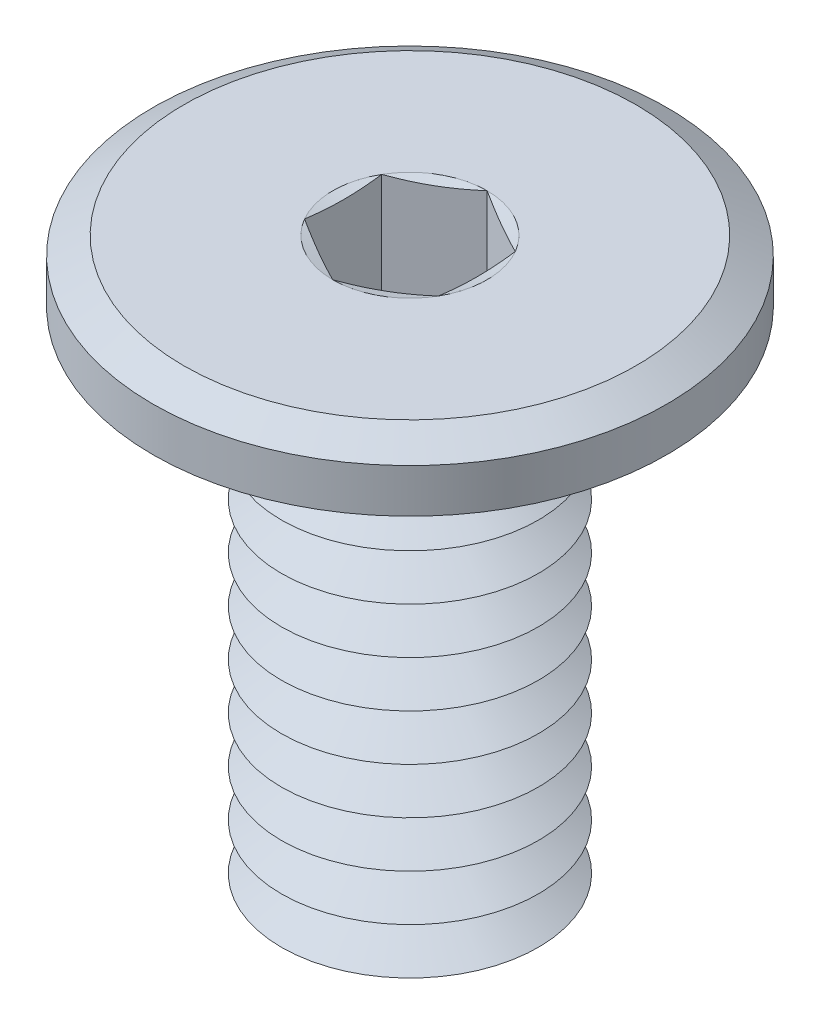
ISO-10303-21;
HEADER;
FILE_DESCRIPTION(('STEP AP214'),'2;1');
FILE_NAME('part.step','',(''),(''),'','','');
FILE_SCHEMA(('AUTOMOTIVE_DESIGN { 1 0 10303 214 1 1 1 1 }'));
ENDSEC;
DATA;
#1=APPLICATION_CONTEXT('core data for automotive mechanical design processes');
#2=APPLICATION_PROTOCOL_DEFINITION('international standard','automotive_design',2000,#1);
#3=PRODUCT_CONTEXT('',#1,'mechanical');
#4=PRODUCT('Part','Part','',(#3));
#5=PRODUCT_RELATED_PRODUCT_CATEGORY('part','',(#4));
#6=PRODUCT_DEFINITION_FORMATION('','',#4);
#7=PRODUCT_DEFINITION_CONTEXT('part definition',#1,'design');
#8=PRODUCT_DEFINITION('design','',#6,#7);
#9=PRODUCT_DEFINITION_SHAPE('','',#8);
#10=(LENGTH_UNIT() NAMED_UNIT(*) SI_UNIT(.MILLI.,.METRE.));
#11=(NAMED_UNIT(*) PLANE_ANGLE_UNIT() SI_UNIT($,.RADIAN.));
#12=(NAMED_UNIT(*) SI_UNIT($,.STERADIAN.) SOLID_ANGLE_UNIT());
#13=UNCERTAINTY_MEASURE_WITH_UNIT(LENGTH_MEASURE(1.E-05),#10,'distance_accuracy_value','');
#14=(GEOMETRIC_REPRESENTATION_CONTEXT(3) GLOBAL_UNCERTAINTY_ASSIGNED_CONTEXT((#13)) GLOBAL_UNIT_ASSIGNED_CONTEXT((#10,
#11,#12)) REPRESENTATION_CONTEXT('',''));
#15=CARTESIAN_POINT('',(0.,0.,0.));
#16=DIRECTION('',(0.,0.,1.));
#17=DIRECTION('',(1.,0.,0.));
#18=AXIS2_PLACEMENT_3D('',#15,#16,#17);
#19=CARTESIAN_POINT('',(0.,-4.925,0.));
#20=DIRECTION('',(0.,-1.,0.));
#21=DIRECTION('',(0.,0.,-1.));
#22=AXIS2_PLACEMENT_3D('',#19,#20,#21);
#23=CONICAL_SURFACE('',#22,1.25,1.0471975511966);
#24=CARTESIAN_POINT('',(0.,-4.7,0.));
#25=DIRECTION('',(0.,1.,0.));
#26=DIRECTION('',(0.,0.,1.));
#27=AXIS2_PLACEMENT_3D('',#24,#25,#26);
#28=CIRCLE('',#27,0.860288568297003);
#29=CARTESIAN_POINT('',(0.,-4.7,0.860288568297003));
#30=VERTEX_POINT('',#29);
#31=EDGE_CURVE('E433',#30,#30,#28,.T.);
#32=ORIENTED_EDGE('',*,*,#31,.F.);
#33=EDGE_LOOP('',(#32));
#34=FACE_BOUND('',#33,.T.);
#35=CARTESIAN_POINT('',(0.,-4.925,0.));
#36=DIRECTION('',(0.,1.,0.));
#37=DIRECTION('',(0.,0.,1.));
#38=AXIS2_PLACEMENT_3D('',#35,#36,#37);
#39=CIRCLE('',#38,1.25);
#40=CARTESIAN_POINT('',(0.,-4.925,1.25));
#41=VERTEX_POINT('',#40);
#42=EDGE_CURVE('E437',#41,#41,#39,.T.);
#43=ORIENTED_EDGE('',*,*,#42,.T.);
#44=EDGE_LOOP('',(#43));
#45=FACE_BOUND('',#44,.T.);
#46=ADVANCED_FACE('F39',(#34,#45),#23,.T.);
#47=CARTESIAN_POINT('',(0.,-4.7,0.));
#48=DIRECTION('',(0.,1.,0.));
#49=DIRECTION('',(0.,0.,1.));
#50=AXIS2_PLACEMENT_3D('',#47,#48,#49);
#51=CONICAL_SURFACE('',#50,0.860288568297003,1.0471975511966);
#52=CARTESIAN_POINT('',(0.,-4.475,0.));
#53=DIRECTION('',(0.,1.,0.));
#54=DIRECTION('',(0.,0.,1.));
#55=AXIS2_PLACEMENT_3D('',#52,#53,#54);
#56=CIRCLE('',#55,1.25);
#57=CARTESIAN_POINT('',(0.,-4.475,1.25));
#58=VERTEX_POINT('',#57);
#59=EDGE_CURVE('E429',#58,#58,#56,.T.);
#60=ORIENTED_EDGE('',*,*,#59,.F.);
#61=EDGE_LOOP('',(#60));
#62=FACE_BOUND('',#61,.T.);
#63=ORIENTED_EDGE('',*,*,#31,.T.);
#64=EDGE_LOOP('',(#63));
#65=FACE_BOUND('',#64,.T.);
#66=ADVANCED_FACE('F233',(#62,#65),#51,.T.);
#67=CARTESIAN_POINT('',(0.,-5.6,0.));
#68=DIRECTION('',(0.,-1.,0.));
#69=DIRECTION('',(0.,0.,-1.));
#70=AXIS2_PLACEMENT_3D('',#67,#68,#69);
#71=PLANE('',#70);
#72=CARTESIAN_POINT('',(0.,-5.6,0.));
#73=DIRECTION('',(0.,1.,0.));
#74=DIRECTION('',(0.,0.,1.));
#75=AXIS2_PLACEMENT_3D('',#72,#73,#74);
#76=CIRCLE('',#75,0.860288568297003);
#77=CARTESIAN_POINT('',(0.,-5.6,0.860288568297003));
#78=VERTEX_POINT('',#77);
#79=EDGE_CURVE('E299',#78,#78,#76,.T.);
#80=ORIENTED_EDGE('',*,*,#79,.F.);
#81=EDGE_LOOP('',(#80));
#82=FACE_BOUND('',#81,.T.);
#83=ADVANCED_FACE('F239',(#82),#71,.T.);
#84=CARTESIAN_POINT('',(0.,-5.6,0.));
#85=DIRECTION('',(0.,1.,0.));
#86=DIRECTION('',(0.,0.,1.));
#87=AXIS2_PLACEMENT_3D('',#84,#85,#86);
#88=CONICAL_SURFACE('',#87,0.860288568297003,1.0471975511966);
#89=CARTESIAN_POINT('',(0.,-5.375,0.));
#90=DIRECTION('',(0.,1.,0.));
#91=DIRECTION('',(0.,0.,1.));
#92=AXIS2_PLACEMENT_3D('',#89,#90,#91);
#93=CIRCLE('',#92,1.25);
#94=CARTESIAN_POINT('',(0.,-5.375,1.25));
#95=VERTEX_POINT('',#94);
#96=EDGE_CURVE('E445',#95,#95,#93,.T.);
#97=ORIENTED_EDGE('',*,*,#96,.F.);
#98=EDGE_LOOP('',(#97));
#99=FACE_BOUND('',#98,.T.);
#100=ORIENTED_EDGE('',*,*,#79,.T.);
#101=EDGE_LOOP('',(#100));
#102=FACE_BOUND('',#101,.T.);
#103=ADVANCED_FACE('F254',(#99,#102),#88,.T.);
#104=CARTESIAN_POINT('',(0.,-5.375,0.));
#105=DIRECTION('',(0.,-1.,0.));
#106=DIRECTION('',(0.,0.,-1.));
#107=AXIS2_PLACEMENT_3D('',#104,#105,#106);
#108=CONICAL_SURFACE('',#107,1.25,1.0471975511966);
#109=CARTESIAN_POINT('',(0.,-5.15,0.));
#110=DIRECTION('',(0.,1.,0.));
#111=DIRECTION('',(0.,0.,1.));
#112=AXIS2_PLACEMENT_3D('',#109,#110,#111);
#113=CIRCLE('',#112,0.860288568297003);
#114=CARTESIAN_POINT('',(0.,-5.15,0.860288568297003));
#115=VERTEX_POINT('',#114);
#116=EDGE_CURVE('E441',#115,#115,#113,.T.);
#117=ORIENTED_EDGE('',*,*,#116,.F.);
#118=EDGE_LOOP('',(#117));
#119=FACE_BOUND('',#118,.T.);
#120=ORIENTED_EDGE('',*,*,#96,.T.);
#121=EDGE_LOOP('',(#120));
#122=FACE_BOUND('',#121,.T.);
#123=ADVANCED_FACE('F250',(#119,#122),#108,.T.);
#124=CARTESIAN_POINT('',(0.,-5.15,0.));
#125=DIRECTION('',(0.,1.,0.));
#126=DIRECTION('',(0.,0.,1.));
#127=AXIS2_PLACEMENT_3D('',#124,#125,#126);
#128=CONICAL_SURFACE('',#127,0.860288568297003,1.0471975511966);
#129=ORIENTED_EDGE('',*,*,#42,.F.);
#130=EDGE_LOOP('',(#129));
#131=FACE_BOUND('',#130,.T.);
#132=ORIENTED_EDGE('',*,*,#116,.T.);
#133=EDGE_LOOP('',(#132));
#134=FACE_BOUND('',#133,.T.);
#135=ADVANCED_FACE('F246',(#131,#134),#128,.T.);
#136=CARTESIAN_POINT('',(0.,-4.475,0.));
#137=DIRECTION('',(0.,-1.,0.));
#138=DIRECTION('',(0.,0.,-1.));
#139=AXIS2_PLACEMENT_3D('',#136,#137,#138);
#140=CONICAL_SURFACE('',#139,1.25,1.0471975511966);
#141=CARTESIAN_POINT('',(0.,-4.25,0.));
#142=DIRECTION('',(0.,1.,0.));
#143=DIRECTION('',(0.,0.,1.));
#144=AXIS2_PLACEMENT_3D('',#141,#142,#143);
#145=CIRCLE('',#144,0.860288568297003);
#146=CARTESIAN_POINT('',(0.,-4.25,0.860288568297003));
#147=VERTEX_POINT('',#146);
#148=EDGE_CURVE('E425',#147,#147,#145,.T.);
#149=ORIENTED_EDGE('',*,*,#148,.F.);
#150=EDGE_LOOP('',(#149));
#151=FACE_BOUND('',#150,.T.);
#152=ORIENTED_EDGE('',*,*,#59,.T.);
#153=EDGE_LOOP('',(#152));
#154=FACE_BOUND('',#153,.T.);
#155=ADVANCED_FACE('F249',(#151,#154),#140,.T.);
#156=CARTESIAN_POINT('',(0.,-4.25,0.));
#157=DIRECTION('',(0.,1.,0.));
#158=DIRECTION('',(0.,0.,1.));
#159=AXIS2_PLACEMENT_3D('',#156,#157,#158);
#160=CONICAL_SURFACE('',#159,0.860288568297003,1.0471975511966);
#161=CARTESIAN_POINT('',(0.,-4.025,0.));
#162=DIRECTION('',(0.,1.,0.));
#163=DIRECTION('',(0.,0.,1.));
#164=AXIS2_PLACEMENT_3D('',#161,#162,#163);
#165=CIRCLE('',#164,1.25);
#166=CARTESIAN_POINT('',(0.,-4.025,1.25));
#167=VERTEX_POINT('',#166);
#168=EDGE_CURVE('E421',#167,#167,#165,.T.);
#169=ORIENTED_EDGE('',*,*,#168,.F.);
#170=EDGE_LOOP('',(#169));
#171=FACE_BOUND('',#170,.T.);
#172=ORIENTED_EDGE('',*,*,#148,.T.);
#173=EDGE_LOOP('',(#172));
#174=FACE_BOUND('',#173,.T.);
#175=ADVANCED_FACE('F550',(#171,#174),#160,.T.);
#176=CARTESIAN_POINT('',(0.,-4.025,0.));
#177=DIRECTION('',(0.,-1.,0.));
#178=DIRECTION('',(0.,0.,-1.));
#179=AXIS2_PLACEMENT_3D('',#176,#177,#178);
#180=CONICAL_SURFACE('',#179,1.25,1.0471975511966);
#181=CARTESIAN_POINT('',(0.,-3.8,0.));
#182=DIRECTION('',(0.,1.,0.));
#183=DIRECTION('',(0.,0.,1.));
#184=AXIS2_PLACEMENT_3D('',#181,#182,#183);
#185=CIRCLE('',#184,0.860288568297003);
#186=CARTESIAN_POINT('',(0.,-3.8,0.860288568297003));
#187=VERTEX_POINT('',#186);
#188=EDGE_CURVE('E417',#187,#187,#185,.T.);
#189=ORIENTED_EDGE('',*,*,#188,.F.);
#190=EDGE_LOOP('',(#189));
#191=FACE_BOUND('',#190,.T.);
#192=ORIENTED_EDGE('',*,*,#168,.T.);
#193=EDGE_LOOP('',(#192));
#194=FACE_BOUND('',#193,.T.);
#195=ADVANCED_FACE('F546',(#191,#194),#180,.T.);
#196=CARTESIAN_POINT('',(0.,-3.8,0.));
#197=DIRECTION('',(0.,1.,0.));
#198=DIRECTION('',(0.,0.,1.));
#199=AXIS2_PLACEMENT_3D('',#196,#197,#198);
#200=CONICAL_SURFACE('',#199,0.860288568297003,1.0471975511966);
#201=CARTESIAN_POINT('',(0.,-3.575,0.));
#202=DIRECTION('',(0.,1.,0.));
#203=DIRECTION('',(0.,0.,1.));
#204=AXIS2_PLACEMENT_3D('',#201,#202,#203);
#205=CIRCLE('',#204,1.25);
#206=CARTESIAN_POINT('',(0.,-3.575,1.25));
#207=VERTEX_POINT('',#206);
#208=EDGE_CURVE('E413',#207,#207,#205,.T.);
#209=ORIENTED_EDGE('',*,*,#208,.F.);
#210=EDGE_LOOP('',(#209));
#211=FACE_BOUND('',#210,.T.);
#212=ORIENTED_EDGE('',*,*,#188,.T.);
#213=EDGE_LOOP('',(#212));
#214=FACE_BOUND('',#213,.T.);
#215=ADVANCED_FACE('F542',(#211,#214),#200,.T.);
#216=CARTESIAN_POINT('',(0.,-3.575,0.));
#217=DIRECTION('',(0.,-1.,0.));
#218=DIRECTION('',(0.,0.,-1.));
#219=AXIS2_PLACEMENT_3D('',#216,#217,#218);
#220=CONICAL_SURFACE('',#219,1.25,1.0471975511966);
#221=CARTESIAN_POINT('',(0.,-3.35,0.));
#222=DIRECTION('',(0.,1.,0.));
#223=DIRECTION('',(0.,0.,1.));
#224=AXIS2_PLACEMENT_3D('',#221,#222,#223);
#225=CIRCLE('',#224,0.860288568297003);
#226=CARTESIAN_POINT('',(0.,-3.35,0.860288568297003));
#227=VERTEX_POINT('',#226);
#228=EDGE_CURVE('E410',#227,#227,#225,.T.);
#229=ORIENTED_EDGE('',*,*,#228,.F.);
#230=EDGE_LOOP('',(#229));
#231=FACE_BOUND('',#230,.T.);
#232=ORIENTED_EDGE('',*,*,#208,.T.);
#233=EDGE_LOOP('',(#232));
#234=FACE_BOUND('',#233,.T.);
#235=ADVANCED_FACE('F538',(#231,#234),#220,.T.);
#236=CARTESIAN_POINT('',(0.,-3.35,0.));
#237=DIRECTION('',(0.,1.,0.));
#238=DIRECTION('',(0.,0.,1.));
#239=AXIS2_PLACEMENT_3D('',#236,#237,#238);
#240=CONICAL_SURFACE('',#239,0.860288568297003,1.0471975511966);
#241=CARTESIAN_POINT('',(0.,-3.125,0.));
#242=DIRECTION('',(0.,1.,0.));
#243=DIRECTION('',(0.,0.,1.));
#244=AXIS2_PLACEMENT_3D('',#241,#242,#243);
#245=CIRCLE('',#244,1.25);
#246=CARTESIAN_POINT('',(0.,-3.125,1.25));
#247=VERTEX_POINT('',#246);
#248=EDGE_CURVE('E406',#247,#247,#245,.T.);
#249=ORIENTED_EDGE('',*,*,#248,.F.);
#250=EDGE_LOOP('',(#249));
#251=FACE_BOUND('',#250,.T.);
#252=ORIENTED_EDGE('',*,*,#228,.T.);
#253=EDGE_LOOP('',(#252));
#254=FACE_BOUND('',#253,.T.);
#255=ADVANCED_FACE('F534',(#251,#254),#240,.T.);
#256=CARTESIAN_POINT('',(0.,-3.125,0.));
#257=DIRECTION('',(0.,-1.,0.));
#258=DIRECTION('',(0.,0.,-1.));
#259=AXIS2_PLACEMENT_3D('',#256,#257,#258);
#260=CONICAL_SURFACE('',#259,1.25,1.0471975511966);
#261=CARTESIAN_POINT('',(0.,-2.9,0.));
#262=DIRECTION('',(0.,1.,0.));
#263=DIRECTION('',(0.,0.,1.));
#264=AXIS2_PLACEMENT_3D('',#261,#262,#263);
#265=CIRCLE('',#264,0.860288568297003);
#266=CARTESIAN_POINT('',(0.,-2.9,0.860288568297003));
#267=VERTEX_POINT('',#266);
#268=EDGE_CURVE('E402',#267,#267,#265,.T.);
#269=ORIENTED_EDGE('',*,*,#268,.F.);
#270=EDGE_LOOP('',(#269));
#271=FACE_BOUND('',#270,.T.);
#272=ORIENTED_EDGE('',*,*,#248,.T.);
#273=EDGE_LOOP('',(#272));
#274=FACE_BOUND('',#273,.T.);
#275=ADVANCED_FACE('F530',(#271,#274),#260,.T.);
#276=CARTESIAN_POINT('',(0.,-2.9,0.));
#277=DIRECTION('',(0.,1.,0.));
#278=DIRECTION('',(0.,0.,1.));
#279=AXIS2_PLACEMENT_3D('',#276,#277,#278);
#280=CONICAL_SURFACE('',#279,0.860288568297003,1.0471975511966);
#281=CARTESIAN_POINT('',(0.,-2.675,0.));
#282=DIRECTION('',(0.,1.,0.));
#283=DIRECTION('',(0.,0.,1.));
#284=AXIS2_PLACEMENT_3D('',#281,#282,#283);
#285=CIRCLE('',#284,1.25);
#286=CARTESIAN_POINT('',(0.,-2.675,1.25));
#287=VERTEX_POINT('',#286);
#288=EDGE_CURVE('E398',#287,#287,#285,.T.);
#289=ORIENTED_EDGE('',*,*,#288,.F.);
#290=EDGE_LOOP('',(#289));
#291=FACE_BOUND('',#290,.T.);
#292=ORIENTED_EDGE('',*,*,#268,.T.);
#293=EDGE_LOOP('',(#292));
#294=FACE_BOUND('',#293,.T.);
#295=ADVANCED_FACE('F526',(#291,#294),#280,.T.);
#296=CARTESIAN_POINT('',(0.,-2.675,0.));
#297=DIRECTION('',(0.,-1.,0.));
#298=DIRECTION('',(0.,0.,-1.));
#299=AXIS2_PLACEMENT_3D('',#296,#297,#298);
#300=CONICAL_SURFACE('',#299,1.25,1.0471975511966);
#301=CARTESIAN_POINT('',(0.,-2.45,0.));
#302=DIRECTION('',(0.,1.,0.));
#303=DIRECTION('',(0.,0.,1.));
#304=AXIS2_PLACEMENT_3D('',#301,#302,#303);
#305=CIRCLE('',#304,0.860288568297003);
#306=CARTESIAN_POINT('',(0.,-2.45,0.860288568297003));
#307=VERTEX_POINT('',#306);
#308=EDGE_CURVE('E394',#307,#307,#305,.T.);
#309=ORIENTED_EDGE('',*,*,#308,.F.);
#310=EDGE_LOOP('',(#309));
#311=FACE_BOUND('',#310,.T.);
#312=ORIENTED_EDGE('',*,*,#288,.T.);
#313=EDGE_LOOP('',(#312));
#314=FACE_BOUND('',#313,.T.);
#315=ADVANCED_FACE('F522',(#311,#314),#300,.T.);
#316=CARTESIAN_POINT('',(0.,-2.45,0.));
#317=DIRECTION('',(0.,1.,0.));
#318=DIRECTION('',(0.,0.,1.));
#319=AXIS2_PLACEMENT_3D('',#316,#317,#318);
#320=CONICAL_SURFACE('',#319,0.860288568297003,1.0471975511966);
#321=CARTESIAN_POINT('',(0.,-2.225,0.));
#322=DIRECTION('',(0.,1.,0.));
#323=DIRECTION('',(0.,0.,1.));
#324=AXIS2_PLACEMENT_3D('',#321,#322,#323);
#325=CIRCLE('',#324,1.25);
#326=CARTESIAN_POINT('',(0.,-2.225,1.25));
#327=VERTEX_POINT('',#326);
#328=EDGE_CURVE('E390',#327,#327,#325,.T.);
#329=ORIENTED_EDGE('',*,*,#328,.F.);
#330=EDGE_LOOP('',(#329));
#331=FACE_BOUND('',#330,.T.);
#332=ORIENTED_EDGE('',*,*,#308,.T.);
#333=EDGE_LOOP('',(#332));
#334=FACE_BOUND('',#333,.T.);
#335=ADVANCED_FACE('F518',(#331,#334),#320,.T.);
#336=CARTESIAN_POINT('',(0.,-2.225,0.));
#337=DIRECTION('',(0.,-1.,0.));
#338=DIRECTION('',(0.,0.,-1.));
#339=AXIS2_PLACEMENT_3D('',#336,#337,#338);
#340=CONICAL_SURFACE('',#339,1.25,1.0471975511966);
#341=CARTESIAN_POINT('',(0.,-2.,0.));
#342=DIRECTION('',(0.,1.,0.));
#343=DIRECTION('',(0.,0.,1.));
#344=AXIS2_PLACEMENT_3D('',#341,#342,#343);
#345=CIRCLE('',#344,0.860288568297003);
#346=CARTESIAN_POINT('',(0.,-2.,0.860288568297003));
#347=VERTEX_POINT('',#346);
#348=EDGE_CURVE('E387',#347,#347,#345,.T.);
#349=ORIENTED_EDGE('',*,*,#348,.F.);
#350=EDGE_LOOP('',(#349));
#351=FACE_BOUND('',#350,.T.);
#352=ORIENTED_EDGE('',*,*,#328,.T.);
#353=EDGE_LOOP('',(#352));
#354=FACE_BOUND('',#353,.T.);
#355=ADVANCED_FACE('F514',(#351,#354),#340,.T.);
#356=CARTESIAN_POINT('',(0.,-2.,0.));
#357=DIRECTION('',(0.,1.,0.));
#358=DIRECTION('',(0.,0.,1.));
#359=AXIS2_PLACEMENT_3D('',#356,#357,#358);
#360=CONICAL_SURFACE('',#359,0.860288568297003,1.0471975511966);
#361=CARTESIAN_POINT('',(0.,-1.775,0.));
#362=DIRECTION('',(0.,1.,0.));
#363=DIRECTION('',(0.,0.,1.));
#364=AXIS2_PLACEMENT_3D('',#361,#362,#363);
#365=CIRCLE('',#364,1.25);
#366=CARTESIAN_POINT('',(0.,-1.775,1.25));
#367=VERTEX_POINT('',#366);
#368=EDGE_CURVE('E383',#367,#367,#365,.T.);
#369=ORIENTED_EDGE('',*,*,#368,.F.);
#370=EDGE_LOOP('',(#369));
#371=FACE_BOUND('',#370,.T.);
#372=ORIENTED_EDGE('',*,*,#348,.T.);
#373=EDGE_LOOP('',(#372));
#374=FACE_BOUND('',#373,.T.);
#375=ADVANCED_FACE('F510',(#371,#374),#360,.T.);
#376=CARTESIAN_POINT('',(0.,-1.775,0.));
#377=DIRECTION('',(0.,-1.,0.));
#378=DIRECTION('',(0.,0.,-1.));
#379=AXIS2_PLACEMENT_3D('',#376,#377,#378);
#380=CONICAL_SURFACE('',#379,1.25,1.0471975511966);
#381=CARTESIAN_POINT('',(0.,-1.55,0.));
#382=DIRECTION('',(0.,1.,0.));
#383=DIRECTION('',(0.,0.,1.));
#384=AXIS2_PLACEMENT_3D('',#381,#382,#383);
#385=CIRCLE('',#384,0.860288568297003);
#386=CARTESIAN_POINT('',(0.,-1.55,0.860288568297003));
#387=VERTEX_POINT('',#386);
#388=EDGE_CURVE('E379',#387,#387,#385,.T.);
#389=ORIENTED_EDGE('',*,*,#388,.F.);
#390=EDGE_LOOP('',(#389));
#391=FACE_BOUND('',#390,.T.);
#392=ORIENTED_EDGE('',*,*,#368,.T.);
#393=EDGE_LOOP('',(#392));
#394=FACE_BOUND('',#393,.T.);
#395=ADVANCED_FACE('F506',(#391,#394),#380,.T.);
#396=CARTESIAN_POINT('',(0.,-1.55,0.));
#397=DIRECTION('',(0.,1.,0.));
#398=DIRECTION('',(0.,0.,1.));
#399=AXIS2_PLACEMENT_3D('',#396,#397,#398);
#400=CONICAL_SURFACE('',#399,0.860288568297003,1.0471975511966);
#401=CARTESIAN_POINT('',(0.,-1.325,0.));
#402=DIRECTION('',(0.,1.,0.));
#403=DIRECTION('',(0.,0.,1.));
#404=AXIS2_PLACEMENT_3D('',#401,#402,#403);
#405=CIRCLE('',#404,1.25);
#406=CARTESIAN_POINT('',(0.,-1.325,1.25));
#407=VERTEX_POINT('',#406);
#408=EDGE_CURVE('E363',#407,#407,#405,.T.);
#409=ORIENTED_EDGE('',*,*,#408,.F.);
#410=EDGE_LOOP('',(#409));
#411=FACE_BOUND('',#410,.T.);
#412=ORIENTED_EDGE('',*,*,#388,.T.);
#413=EDGE_LOOP('',(#412));
#414=FACE_BOUND('',#413,.T.);
#415=ADVANCED_FACE('F274',(#411,#414),#400,.T.);
#416=CARTESIAN_POINT('',(0.,0.,0.));
#417=DIRECTION('',(0.,1.,0.));
#418=DIRECTION('',(0.,0.,1.));
#419=AXIS2_PLACEMENT_3D('',#416,#417,#418);
#420=PLANE('',#419);
#421=CARTESIAN_POINT('',(0.,0.,0.));
#422=DIRECTION('',(0.,1.,0.));
#423=DIRECTION('',(0.,0.,1.));
#424=AXIS2_PLACEMENT_3D('',#421,#422,#423);
#425=CIRCLE('',#424,0.750555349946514);
#426=CARTESIAN_POINT('',(0.,0.,0.750555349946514));
#427=VERTEX_POINT('',#426);
#428=CARTESIAN_POINT('',(0.65,0.,0.375277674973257));
#429=VERTEX_POINT('',#428);
#430=EDGE_CURVE('E66',#427,#429,#425,.T.);
#431=ORIENTED_EDGE('',*,*,#430,.F.);
#432=CARTESIAN_POINT('',(-0.65,0.,0.375277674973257));
#433=VERTEX_POINT('',#432);
#434=EDGE_CURVE('E169',#433,#427,#425,.T.);
#435=ORIENTED_EDGE('',*,*,#434,.F.);
#436=CARTESIAN_POINT('',(-0.65,0.,-0.375277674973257));
#437=VERTEX_POINT('',#436);
#438=EDGE_CURVE('E164',#437,#433,#425,.T.);
#439=ORIENTED_EDGE('',*,*,#438,.F.);
#440=CARTESIAN_POINT('',(0.,0.,-0.750555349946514));
#441=VERTEX_POINT('',#440);
#442=EDGE_CURVE('E128',#441,#437,#425,.T.);
#443=ORIENTED_EDGE('',*,*,#442,.F.);
#444=CARTESIAN_POINT('',(0.65,0.,-0.375277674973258));
#445=VERTEX_POINT('',#444);
#446=EDGE_CURVE('E119',#445,#441,#425,.T.);
#447=ORIENTED_EDGE('',*,*,#446,.F.);
#448=EDGE_CURVE('E59',#429,#445,#425,.T.);
#449=ORIENTED_EDGE('',*,*,#448,.F.);
#450=EDGE_LOOP('',(#431,#435,#439,#443,#447,#449));
#451=FACE_BOUND('',#450,.T.);
#452=CARTESIAN_POINT('',(0.,0.,0.));
#453=DIRECTION('',(0.,1.,0.));
#454=DIRECTION('',(0.,0.,1.));
#455=AXIS2_PLACEMENT_3D('',#452,#453,#454);
#456=CIRCLE('',#455,2.2);
#457=CARTESIAN_POINT('',(0.,0.,2.2));
#458=VERTEX_POINT('',#457);
#459=EDGE_CURVE('E295',#458,#458,#456,.T.);
#460=ORIENTED_EDGE('',*,*,#459,.T.);
#461=EDGE_LOOP('',(#460));
#462=FACE_BOUND('',#461,.T.);
#463=ADVANCED_FACE('F160',(#451,#462),#420,.T.);
#464=CARTESIAN_POINT('',(0.,-0.6,0.));
#465=DIRECTION('',(0.,1.,0.));
#466=DIRECTION('',(0.,0.,1.));
#467=AXIS2_PLACEMENT_3D('',#464,#465,#466);
#468=CYLINDRICAL_SURFACE('',#467,2.5);
#469=CARTESIAN_POINT('',(0.,-0.173205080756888,0.));
#470=DIRECTION('',(0.,1.,0.));
#471=DIRECTION('',(0.,0.,1.));
#472=AXIS2_PLACEMENT_3D('',#469,#470,#471);
#473=CIRCLE('',#472,2.5);
#474=CARTESIAN_POINT('',(0.,-0.173205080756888,2.5));
#475=VERTEX_POINT('',#474);
#476=EDGE_CURVE('E305',#475,#475,#473,.F.);
#477=ORIENTED_EDGE('',*,*,#476,.T.);
#478=EDGE_LOOP('',(#477));
#479=FACE_BOUND('',#478,.T.);
#480=CARTESIAN_POINT('',(0.,-0.6,0.));
#481=DIRECTION('',(0.,1.,0.));
#482=DIRECTION('',(0.,0.,1.));
#483=AXIS2_PLACEMENT_3D('',#480,#481,#482);
#484=CIRCLE('',#483,2.5);
#485=CARTESIAN_POINT('',(0.,-0.6,2.5));
#486=VERTEX_POINT('',#485);
#487=EDGE_CURVE('E291',#486,#486,#484,.T.);
#488=ORIENTED_EDGE('',*,*,#487,.T.);
#489=EDGE_LOOP('',(#488));
#490=FACE_BOUND('',#489,.T.);
#491=ADVANCED_FACE('F270',(#479,#490),#468,.T.);
#492=CARTESIAN_POINT('',(0.,-0.6,0.));
#493=DIRECTION('',(0.,1.,0.));
#494=DIRECTION('',(0.,0.,1.));
#495=AXIS2_PLACEMENT_3D('',#492,#493,#494);
#496=PLANE('',#495);
#497=CARTESIAN_POINT('',(0.,-0.6,0.));
#498=DIRECTION('',(0.,1.,0.));
#499=DIRECTION('',(0.,0.,1.));
#500=AXIS2_PLACEMENT_3D('',#497,#498,#499);
#501=CIRCLE('',#500,1.35);
#502=CARTESIAN_POINT('',(0.,-0.6,1.35));
#503=VERTEX_POINT('',#502);
#504=EDGE_CURVE('E286',#503,#503,#501,.T.);
#505=ORIENTED_EDGE('',*,*,#504,.T.);
#506=EDGE_LOOP('',(#505));
#507=FACE_BOUND('',#506,.T.);
#508=ORIENTED_EDGE('',*,*,#487,.F.);
#509=EDGE_LOOP('',(#508));
#510=FACE_BOUND('',#509,.T.);
#511=ADVANCED_FACE('F266',(#507,#510),#496,.F.);
#512=CARTESIAN_POINT('',(0.,-5.6,0.));
#513=DIRECTION('',(0.,1.,0.));
#514=DIRECTION('',(0.,0.,1.));
#515=AXIS2_PLACEMENT_3D('',#512,#513,#514);
#516=CYLINDRICAL_SURFACE('',#515,1.25);
#517=CARTESIAN_POINT('',(0.,-0.7,0.));
#518=DIRECTION('',(0.,1.,0.));
#519=DIRECTION('',(0.,0.,1.));
#520=AXIS2_PLACEMENT_3D('',#517,#518,#519);
#521=CIRCLE('',#520,1.25);
#522=CARTESIAN_POINT('',(0.,-0.7,1.25));
#523=VERTEX_POINT('',#522);
#524=EDGE_CURVE('E289',#523,#523,#521,.F.);
#525=ORIENTED_EDGE('',*,*,#524,.T.);
#526=EDGE_LOOP('',(#525));
#527=FACE_BOUND('',#526,.T.);
#528=ORIENTED_EDGE('',*,*,#408,.T.);
#529=EDGE_LOOP('',(#528));
#530=FACE_BOUND('',#529,.T.);
#531=ADVANCED_FACE('F262',(#527,#530),#516,.T.);
#532=CARTESIAN_POINT('',(0.,-0.7,0.));
#533=DIRECTION('',(0.,1.,0.));
#534=DIRECTION('',(0.,0.,1.));
#535=AXIS2_PLACEMENT_3D('',#532,#533,#534);
#536=TOROIDAL_SURFACE('',#535,1.35,0.1);
#537=ORIENTED_EDGE('',*,*,#504,.F.);
#538=EDGE_LOOP('',(#537));
#539=FACE_BOUND('',#538,.T.);
#540=ORIENTED_EDGE('',*,*,#524,.F.);
#541=EDGE_LOOP('',(#540));
#542=FACE_BOUND('',#541,.T.);
#543=ADVANCED_FACE('F265',(#539,#542),#536,.F.);
#544=CARTESIAN_POINT('',(0.,0.,0.));
#545=DIRECTION('',(0.,-1.,0.));
#546=DIRECTION('',(0.,0.,-1.));
#547=AXIS2_PLACEMENT_3D('',#544,#545,#546);
#548=CONICAL_SURFACE('',#547,2.2,1.0471975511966);
#549=ORIENTED_EDGE('',*,*,#476,.F.);
#550=EDGE_LOOP('',(#549));
#551=FACE_BOUND('',#550,.T.);
#552=ORIENTED_EDGE('',*,*,#459,.F.);
#553=EDGE_LOOP('',(#552));
#554=FACE_BOUND('',#553,.T.);
#555=ADVANCED_FACE('F41',(#551,#554),#548,.T.);
#556=CARTESIAN_POINT('',(0.,0.,0.));
#557=DIRECTION('',(0.,1.,0.));
#558=DIRECTION('',(0.,0.,1.));
#559=AXIS2_PLACEMENT_3D('',#556,#557,#558);
#560=CONICAL_SURFACE('',#559,0.750555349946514,1.30899693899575);
#561=ORIENTED_EDGE('',*,*,#442,.T.);
#562=CARTESIAN_POINT('',(0.000200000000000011,3.09472466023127E-05,-0.750670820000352));
#563=CARTESIAN_POINT('',(-0.0268094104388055,-0.00415092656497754,-0.735076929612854));
#564=CARTESIAN_POINT('',(-0.0538678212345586,-0.00794750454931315,-0.719454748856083));
#565=CARTESIAN_POINT('',(-0.108080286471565,-0.0146178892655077,-0.688155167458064));
#566=CARTESIAN_POINT('',(-0.135234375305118,-0.0174913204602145,-0.672477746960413));
#567=CARTESIAN_POINT('',(-0.18947340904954,-0.0221475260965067,-0.641162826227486));
#568=CARTESIAN_POINT('',(-0.216557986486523,-0.0239358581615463,-0.625525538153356));
#569=CARTESIAN_POINT('',(-0.270761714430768,-0.0263338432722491,-0.594231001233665));
#570=CARTESIAN_POINT('',(-0.297880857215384,-0.0269437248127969,-0.578573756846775));
#571=CARTESIAN_POINT('',(-0.352119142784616,-0.0269437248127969,-0.547259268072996));
#572=CARTESIAN_POINT('',(-0.379238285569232,-0.0263338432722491,-0.531602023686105));
#573=CARTESIAN_POINT('',(-0.433442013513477,-0.0239358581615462,-0.500307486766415));
#574=CARTESIAN_POINT('',(-0.460526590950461,-0.0221475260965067,-0.484670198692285));
#575=CARTESIAN_POINT('',(-0.514765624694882,-0.0174913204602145,-0.453355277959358));
#576=CARTESIAN_POINT('',(-0.541919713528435,-0.0146178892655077,-0.437677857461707));
#577=CARTESIAN_POINT('',(-0.596132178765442,-0.00794750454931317,-0.406378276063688));
#578=CARTESIAN_POINT('',(-0.623190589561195,-0.00415092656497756,-0.390756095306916));
#579=CARTESIAN_POINT('',(-0.6502,3.09472466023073E-05,-0.375162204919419));
#580=B_SPLINE_CURVE_WITH_KNOTS('',3,(#562,#563,#564,#565,#566,#567,#568,#569,#570,#571,#572,
#573,#574,#575,#576,#577,#578,#579),.UNSPECIFIED.,.F.,.F.,(4,2,2,2,2,2,2,2,4),(0.,
0.0944056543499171,0.188849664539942,0.282805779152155,0.376743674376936,0.470681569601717,
0.564637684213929,0.659081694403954,0.753487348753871),.UNSPECIFIED.);
#581=EDGE_CURVE('E11',#441,#437,#580,.T.);
#582=ORIENTED_EDGE('',*,*,#581,.F.);
#583=EDGE_LOOP('',(#561,#582));
#584=FACE_BOUND('',#583,.T.);
#585=ADVANCED_FACE('F132',(#584),#560,.F.);
#586=ORIENTED_EDGE('',*,*,#438,.T.);
#587=CARTESIAN_POINT('',(-0.65,0.153431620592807,-1.15250975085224));
#588=CARTESIAN_POINT('',(-0.65,0.140485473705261,-1.09696292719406));
#589=CARTESIAN_POINT('',(-0.65,0.12772104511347,-1.04137089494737));
#590=CARTESIAN_POINT('',(-0.65,0.102806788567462,-0.93003898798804));
#591=CARTESIAN_POINT('',(-0.65,0.0906570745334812,-0.874299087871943));
#592=CARTESIAN_POINT('',(-0.65,0.0671143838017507,-0.762091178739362));
#593=CARTESIAN_POINT('',(-0.65,0.0557299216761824,-0.70562136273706));
#594=CARTESIAN_POINT('',(-0.65,0.0342960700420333,-0.59241870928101));
#595=CARTESIAN_POINT('',(-0.65,0.0242468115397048,-0.535685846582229));
#596=CARTESIAN_POINT('',(-0.65,0.00641278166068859,-0.423455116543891));
#597=CARTESIAN_POINT('',(-0.65,-0.00142665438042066,-0.367966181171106));
#598=CARTESIAN_POINT('',(-0.65,-0.0143371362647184,-0.256669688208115));
#599=CARTESIAN_POINT('',(-0.65,-0.0194090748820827,-0.200862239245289));
#600=CARTESIAN_POINT('',(-0.65,-0.025908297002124,-0.0892782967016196));
#601=CARTESIAN_POINT('',(-0.65,-0.0273521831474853,-0.0335028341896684));
#602=CARTESIAN_POINT('',(-0.65,-0.0263311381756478,0.078014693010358));
#603=CARTESIAN_POINT('',(-0.65,-0.0238659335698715,0.133756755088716));
#604=CARTESIAN_POINT('',(-0.65,-0.016691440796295,0.229596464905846));
#605=CARTESIAN_POINT('',(-0.65,-0.0127907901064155,0.269759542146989));
#606=CARTESIAN_POINT('',(-0.65,-0.00354681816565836,0.349915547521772));
#607=CARTESIAN_POINT('',(-0.65,0.00179646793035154,0.389908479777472));
#608=CARTESIAN_POINT('',(-0.65,0.0195190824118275,0.50990254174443));
#609=CARTESIAN_POINT('',(-0.65,0.0335668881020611,0.589653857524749));
#610=CARTESIAN_POINT('',(-0.65,0.0566589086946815,0.709742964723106));
#611=CARTESIAN_POINT('',(-0.65,0.0647873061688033,0.750268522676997));
#612=CARTESIAN_POINT('',(-0.65,0.0815416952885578,0.831218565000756));
#613=CARTESIAN_POINT('',(-0.65,0.0901676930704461,0.871643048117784));
#614=CARTESIAN_POINT('',(-0.65,0.107740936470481,0.952178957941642));
#615=CARTESIAN_POINT('',(-0.65,0.116686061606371,0.992290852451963));
#616=CARTESIAN_POINT('',(-0.65,0.134863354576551,1.07244661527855));
#617=CARTESIAN_POINT('',(-0.65,0.144095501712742,1.11249048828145));
#618=CARTESIAN_POINT('',(-0.65,0.153431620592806,1.15250975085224));
#619=B_SPLINE_CURVE_WITH_KNOTS('',3,(#587,#588,#589,#590,#591,#592,#593,#594,#595,#596,#597,
#598,#599,#600,#601,#602,#603,#604,#605,#606,#607,#608,#609,#610,#611,#612,#613,#614,#615,#616,
#617,#618),.UNSPECIFIED.,.F.,.F.,(4,2,2,2,2,2,2,2,2,2,2,2,2,2,2,4),(0.,0.171110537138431,
0.342252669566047,0.515060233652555,0.687884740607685,0.855957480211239,1.02397596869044,
1.19122416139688,1.3584840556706,1.4795115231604,1.60053604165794,1.84338230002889,
1.9673809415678,2.09138111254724,2.21467179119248,2.33795359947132),.UNSPECIFIED.);
#620=EDGE_CURVE('E172',#437,#433,#619,.T.);
#621=ORIENTED_EDGE('',*,*,#620,.F.);
#622=EDGE_LOOP('',(#586,#621));
#623=FACE_BOUND('',#622,.T.);
#624=ADVANCED_FACE('F632',(#623),#560,.F.);
#625=ORIENTED_EDGE('',*,*,#434,.T.);
#626=CARTESIAN_POINT('',(-0.6502,3.09472466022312E-05,0.375162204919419));
#627=CARTESIAN_POINT('',(-0.623190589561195,-0.0041509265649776,0.390756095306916));
#628=CARTESIAN_POINT('',(-0.596132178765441,-0.00794750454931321,0.406378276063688));
#629=CARTESIAN_POINT('',(-0.541919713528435,-0.0146178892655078,0.437677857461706));
#630=CARTESIAN_POINT('',(-0.514765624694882,-0.0174913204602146,0.453355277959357));
#631=CARTESIAN_POINT('',(-0.460526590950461,-0.0221475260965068,0.484670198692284));
#632=CARTESIAN_POINT('',(-0.433442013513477,-0.0239358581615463,0.500307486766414));
#633=CARTESIAN_POINT('',(-0.379238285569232,-0.0263338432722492,0.531602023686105));
#634=CARTESIAN_POINT('',(-0.352119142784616,-0.026943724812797,0.547259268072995));
#635=CARTESIAN_POINT('',(-0.297880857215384,-0.026943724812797,0.578573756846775));
#636=CARTESIAN_POINT('',(-0.270761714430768,-0.0263338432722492,0.594231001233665));
#637=CARTESIAN_POINT('',(-0.216557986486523,-0.0239358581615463,0.625525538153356));
#638=CARTESIAN_POINT('',(-0.18947340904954,-0.0221475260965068,0.641162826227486));
#639=CARTESIAN_POINT('',(-0.135234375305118,-0.0174913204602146,0.672477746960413));
#640=CARTESIAN_POINT('',(-0.108080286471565,-0.0146178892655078,0.688155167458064));
#641=CARTESIAN_POINT('',(-0.0538678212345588,-0.00794750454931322,0.719454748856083));
#642=CARTESIAN_POINT('',(-0.0268094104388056,-0.0041509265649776,0.735076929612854));
#643=CARTESIAN_POINT('',(0.000199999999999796,3.09472466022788E-05,0.750670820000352));
#644=B_SPLINE_CURVE_WITH_KNOTS('',3,(#626,#627,#628,#629,#630,#631,#632,#633,#634,#635,#636,
#637,#638,#639,#640,#641,#642,#643),.UNSPECIFIED.,.F.,.F.,(4,2,2,2,2,2,2,2,4),(0.,
0.0944056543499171,0.188849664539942,0.282805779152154,0.376743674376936,0.470681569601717,
0.564637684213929,0.659081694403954,0.753487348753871),.UNSPECIFIED.);
#645=EDGE_CURVE('E180',#433,#427,#644,.T.);
#646=ORIENTED_EDGE('',*,*,#645,.F.);
#647=EDGE_LOOP('',(#625,#646));
#648=FACE_BOUND('',#647,.T.);
#649=ADVANCED_FACE('F456',(#648),#560,.F.);
#650=ORIENTED_EDGE('',*,*,#430,.T.);
#651=CARTESIAN_POINT('',(-0.000200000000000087,3.09472466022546E-05,0.750670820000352));
#652=CARTESIAN_POINT('',(0.0268094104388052,-0.00415092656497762,0.735076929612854));
#653=CARTESIAN_POINT('',(0.0538678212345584,-0.00794750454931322,0.719454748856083));
#654=CARTESIAN_POINT('',(0.108080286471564,-0.0146178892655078,0.688155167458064));
#655=CARTESIAN_POINT('',(0.135234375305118,-0.0174913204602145,0.672477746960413));
#656=CARTESIAN_POINT('',(0.189473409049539,-0.0221475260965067,0.641162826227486));
#657=CARTESIAN_POINT('',(0.216557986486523,-0.0239358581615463,0.625525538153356));
#658=CARTESIAN_POINT('',(0.270761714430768,-0.0263338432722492,0.594231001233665));
#659=CARTESIAN_POINT('',(0.297880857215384,-0.0269437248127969,0.578573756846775));
#660=CARTESIAN_POINT('',(0.352119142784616,-0.0269437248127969,0.547259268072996));
#661=CARTESIAN_POINT('',(0.379238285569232,-0.0263338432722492,0.531602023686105));
#662=CARTESIAN_POINT('',(0.433442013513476,-0.0239358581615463,0.500307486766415));
#663=CARTESIAN_POINT('',(0.46052659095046,-0.0221475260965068,0.484670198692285));
#664=CARTESIAN_POINT('',(0.514765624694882,-0.0174913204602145,0.453355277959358));
#665=CARTESIAN_POINT('',(0.541919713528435,-0.0146178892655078,0.437677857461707));
#666=CARTESIAN_POINT('',(0.596132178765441,-0.00794750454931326,0.406378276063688));
#667=CARTESIAN_POINT('',(0.623190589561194,-0.00415092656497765,0.390756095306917));
#668=CARTESIAN_POINT('',(0.6502,3.09472466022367E-05,0.375162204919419));
#669=B_SPLINE_CURVE_WITH_KNOTS('',3,(#651,#652,#653,#654,#655,#656,#657,#658,#659,#660,#661,
#662,#663,#664,#665,#666,#667,#668),.UNSPECIFIED.,.F.,.F.,(4,2,2,2,2,2,2,2,4),(0.,
0.0944056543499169,0.188849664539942,0.282805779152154,0.376743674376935,0.470681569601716,
0.564637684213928,0.659081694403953,0.753487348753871),.UNSPECIFIED.);
#670=EDGE_CURVE('E199',#427,#429,#669,.T.);
#671=ORIENTED_EDGE('',*,*,#670,.F.);
#672=EDGE_LOOP('',(#650,#671));
#673=FACE_BOUND('',#672,.T.);
#674=ADVANCED_FACE('F459',(#673),#560,.F.);
#675=ORIENTED_EDGE('',*,*,#448,.T.);
#676=CARTESIAN_POINT('',(0.65,0.153431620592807,1.15250975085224));
#677=CARTESIAN_POINT('',(0.65,0.140485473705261,1.09696292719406));
#678=CARTESIAN_POINT('',(0.65,0.12772104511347,1.04137089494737));
#679=CARTESIAN_POINT('',(0.65,0.102806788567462,0.93003898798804));
#680=CARTESIAN_POINT('',(0.65,0.0906570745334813,0.874299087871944));
#681=CARTESIAN_POINT('',(0.65,0.0671143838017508,0.762091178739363));
#682=CARTESIAN_POINT('',(0.65,0.0557299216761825,0.705621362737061));
#683=CARTESIAN_POINT('',(0.65,0.0342960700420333,0.592418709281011));
#684=CARTESIAN_POINT('',(0.65,0.0242468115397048,0.53568584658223));
#685=CARTESIAN_POINT('',(0.65,0.00641278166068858,0.423455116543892));
#686=CARTESIAN_POINT('',(0.65,-0.00142665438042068,0.367966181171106));
#687=CARTESIAN_POINT('',(0.65,-0.0143371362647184,0.256669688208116));
#688=CARTESIAN_POINT('',(0.65,-0.0194090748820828,0.200862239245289));
#689=CARTESIAN_POINT('',(0.65,-0.0259082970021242,0.08927829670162));
#690=CARTESIAN_POINT('',(0.65,-0.0273521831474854,0.0335028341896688));
#691=CARTESIAN_POINT('',(0.65,-0.0263311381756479,-0.0780146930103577));
#692=CARTESIAN_POINT('',(0.65,-0.0238659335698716,-0.133756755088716));
#693=CARTESIAN_POINT('',(0.65,-0.0166914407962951,-0.229596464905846));
#694=CARTESIAN_POINT('',(0.65,-0.0127907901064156,-0.269759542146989));
#695=CARTESIAN_POINT('',(0.65,-0.00354681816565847,-0.349915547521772));
#696=CARTESIAN_POINT('',(0.65,0.00179646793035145,-0.389908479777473));
#697=CARTESIAN_POINT('',(0.65,0.0195190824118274,-0.509902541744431));
#698=CARTESIAN_POINT('',(0.649999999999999,0.033566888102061,-0.589653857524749));
#699=CARTESIAN_POINT('',(0.649999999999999,0.0566589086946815,-0.709742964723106));
#700=CARTESIAN_POINT('',(0.649999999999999,0.0647873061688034,-0.750268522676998));
#701=CARTESIAN_POINT('',(0.649999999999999,0.081541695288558,-0.831218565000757));
#702=CARTESIAN_POINT('',(0.649999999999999,0.0901676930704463,-0.871643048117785));
#703=CARTESIAN_POINT('',(0.649999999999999,0.107740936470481,-0.952178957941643));
#704=CARTESIAN_POINT('',(0.649999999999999,0.116686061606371,-0.992290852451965));
#705=CARTESIAN_POINT('',(0.649999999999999,0.134863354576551,-1.07244661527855));
#706=CARTESIAN_POINT('',(0.649999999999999,0.144095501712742,-1.11249048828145));
#707=CARTESIAN_POINT('',(0.649999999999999,0.153431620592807,-1.15250975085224));
#708=B_SPLINE_CURVE_WITH_KNOTS('',3,(#676,#677,#678,#679,#680,#681,#682,#683,#684,#685,#686,
#687,#688,#689,#690,#691,#692,#693,#694,#695,#696,#697,#698,#699,#700,#701,#702,#703,#704,#705,
#706,#707),.UNSPECIFIED.,.F.,.F.,(4,2,2,2,2,2,2,2,2,2,2,2,2,2,2,4),(0.,0.171110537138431,
0.342252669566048,0.515060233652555,0.687884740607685,0.855957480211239,1.02397596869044,
1.19122416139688,1.3584840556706,1.47951152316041,1.60053604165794,1.84338230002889,
1.9673809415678,2.09138111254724,2.21467179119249,2.33795359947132),.UNSPECIFIED.);
#709=EDGE_CURVE('E149',#429,#445,#708,.T.);
#710=ORIENTED_EDGE('',*,*,#709,.F.);
#711=EDGE_LOOP('',(#675,#710));
#712=FACE_BOUND('',#711,.T.);
#713=ADVANCED_FACE('F192',(#712),#560,.F.);
#714=ORIENTED_EDGE('',*,*,#446,.T.);
#715=CARTESIAN_POINT('',(0.6502,3.09472466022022E-05,-0.375162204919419));
#716=CARTESIAN_POINT('',(0.623190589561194,-0.00415092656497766,-0.390756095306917));
#717=CARTESIAN_POINT('',(0.596132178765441,-0.00794750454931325,-0.406378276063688));
#718=CARTESIAN_POINT('',(0.541919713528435,-0.0146178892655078,-0.437677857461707));
#719=CARTESIAN_POINT('',(0.514765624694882,-0.0174913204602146,-0.453355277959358));
#720=CARTESIAN_POINT('',(0.46052659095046,-0.0221475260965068,-0.484670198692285));
#721=CARTESIAN_POINT('',(0.433442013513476,-0.0239358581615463,-0.500307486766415));
#722=CARTESIAN_POINT('',(0.379238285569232,-0.0263338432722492,-0.531602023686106));
#723=CARTESIAN_POINT('',(0.352119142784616,-0.0269437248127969,-0.547259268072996));
#724=CARTESIAN_POINT('',(0.297880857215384,-0.0269437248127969,-0.578573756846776));
#725=CARTESIAN_POINT('',(0.270761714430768,-0.0263338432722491,-0.594231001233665));
#726=CARTESIAN_POINT('',(0.216557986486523,-0.0239358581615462,-0.625525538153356));
#727=CARTESIAN_POINT('',(0.189473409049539,-0.0221475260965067,-0.641162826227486));
#728=CARTESIAN_POINT('',(0.135234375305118,-0.0174913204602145,-0.672477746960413));
#729=CARTESIAN_POINT('',(0.108080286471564,-0.0146178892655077,-0.688155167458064));
#730=CARTESIAN_POINT('',(0.0538678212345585,-0.00794750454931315,-0.719454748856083));
#731=CARTESIAN_POINT('',(0.0268094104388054,-0.00415092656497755,-0.735076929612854));
#732=CARTESIAN_POINT('',(-0.000200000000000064,3.09472466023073E-05,-0.750670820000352));
#733=B_SPLINE_CURVE_WITH_KNOTS('',3,(#715,#716,#717,#718,#719,#720,#721,#722,#723,#724,#725,
#726,#727,#728,#729,#730,#731,#732),.UNSPECIFIED.,.F.,.F.,(4,2,2,2,2,2,2,2,4),(0.,
0.0944056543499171,0.188849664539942,0.282805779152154,0.376743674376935,0.470681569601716,
0.564637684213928,0.659081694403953,0.75348734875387),.UNSPECIFIED.);
#734=EDGE_CURVE('E123',#445,#441,#733,.T.);
#735=ORIENTED_EDGE('',*,*,#734,.F.);
#736=EDGE_LOOP('',(#714,#735));
#737=FACE_BOUND('',#736,.T.);
#738=ADVANCED_FACE('F121',(#737),#560,.F.);
#739=CARTESIAN_POINT('',(0.,-1.2,0.));
#740=DIRECTION('',(0.,1.,0.));
#741=DIRECTION('',(0.,0.,1.));
#742=AXIS2_PLACEMENT_3D('',#739,#740,#741);
#743=CONICAL_SURFACE('',#742,0.65,1.0471975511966);
#744=CARTESIAN_POINT('',(0.,-1.57527767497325,0.));
#745=VERTEX_POINT('',#744);
#746=VERTEX_LOOP('',#745);
#747=FACE_BOUND('',#746,.T.);
#748=CARTESIAN_POINT('',(0.,-1.2,0.));
#749=DIRECTION('',(0.,1.,0.));
#750=DIRECTION('',(0.,0.,1.));
#751=AXIS2_PLACEMENT_3D('',#748,#749,#750);
#752=CIRCLE('',#751,0.65);
#753=CARTESIAN_POINT('',(0.325,-1.2,0.562916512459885));
#754=VERTEX_POINT('',#753);
#755=CARTESIAN_POINT('',(0.65,-1.2,0.));
#756=VERTEX_POINT('',#755);
#757=EDGE_CURVE('E148',#754,#756,#752,.T.);
#758=ORIENTED_EDGE('',*,*,#757,.T.);
#759=CARTESIAN_POINT('',(0.,-1.2,0.));
#760=DIRECTION('',(0.,1.,0.));
#761=DIRECTION('',(0.,0.,1.));
#762=AXIS2_PLACEMENT_3D('',#759,#760,#761);
#763=CIRCLE('',#762,0.65);
#764=CARTESIAN_POINT('',(0.325,-1.2,-0.562916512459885));
#765=VERTEX_POINT('',#764);
#766=EDGE_CURVE('E53',#756,#765,#763,.T.);
#767=ORIENTED_EDGE('',*,*,#766,.T.);
#768=CARTESIAN_POINT('',(-0.325,-1.2,-0.562916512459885));
#769=VERTEX_POINT('',#768);
#770=EDGE_CURVE('E318',#765,#769,#763,.T.);
#771=ORIENTED_EDGE('',*,*,#770,.T.);
#772=CARTESIAN_POINT('',(-0.65,-1.2,0.));
#773=VERTEX_POINT('',#772);
#774=EDGE_CURVE('E316',#769,#773,#763,.T.);
#775=ORIENTED_EDGE('',*,*,#774,.T.);
#776=CARTESIAN_POINT('',(-0.325,-1.2,0.562916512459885));
#777=VERTEX_POINT('',#776);
#778=EDGE_CURVE('E310',#773,#777,#763,.T.);
#779=ORIENTED_EDGE('',*,*,#778,.T.);
#780=EDGE_CURVE('E308',#777,#754,#763,.T.);
#781=ORIENTED_EDGE('',*,*,#780,.T.);
#782=EDGE_LOOP('',(#758,#767,#771,#775,#779,#781));
#783=FACE_BOUND('',#782,.T.);
#784=ADVANCED_FACE('F191',(#747,#783),#743,.F.);
#785=CARTESIAN_POINT('',(0.,-1.2,0.));
#786=DIRECTION('',(0.,1.,0.));
#787=DIRECTION('',(0.,0.,1.));
#788=AXIS2_PLACEMENT_3D('',#785,#786,#787);
#789=PLANE('',#788);
#790=ORIENTED_EDGE('',*,*,#766,.F.);
#791=DIRECTION('',(0.,0.,-1.));
#792=VECTOR('',#791,1.);
#793=CARTESIAN_POINT('',(0.65,-1.2,0.375277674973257));
#794=LINE('',#793,#792);
#795=CARTESIAN_POINT('',(0.65,-1.2,-0.375277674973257));
#796=VERTEX_POINT('',#795);
#797=EDGE_CURVE('E357',#756,#796,#794,.T.);
#798=ORIENTED_EDGE('',*,*,#797,.T.);
#799=DIRECTION('',(-0.866025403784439,0.,-0.5));
#800=VECTOR('',#799,1.);
#801=CARTESIAN_POINT('',(0.65,-1.2,-0.375277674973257));
#802=LINE('',#801,#800);
#803=EDGE_CURVE('E484',#796,#765,#802,.T.);
#804=ORIENTED_EDGE('',*,*,#803,.T.);
#805=EDGE_LOOP('',(#790,#798,#804));
#806=FACE_BOUND('',#805,.T.);
#807=ADVANCED_FACE('F474',(#806),#789,.T.);
#808=ORIENTED_EDGE('',*,*,#757,.F.);
#809=DIRECTION('',(0.866025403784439,0.,-0.5));
#810=VECTOR('',#809,1.);
#811=CARTESIAN_POINT('',(0.,-1.2,0.750555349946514));
#812=LINE('',#811,#810);
#813=CARTESIAN_POINT('',(0.65,-1.2,0.375277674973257));
#814=VERTEX_POINT('',#813);
#815=EDGE_CURVE('E353',#754,#814,#812,.T.);
#816=ORIENTED_EDGE('',*,*,#815,.T.);
#817=EDGE_CURVE('E157',#814,#756,#794,.T.);
#818=ORIENTED_EDGE('',*,*,#817,.T.);
#819=EDGE_LOOP('',(#808,#816,#818));
#820=FACE_BOUND('',#819,.T.);
#821=ADVANCED_FACE('F468',(#820),#789,.T.);
#822=ORIENTED_EDGE('',*,*,#780,.F.);
#823=DIRECTION('',(0.866025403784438,0.,0.5));
#824=VECTOR('',#823,1.);
#825=CARTESIAN_POINT('',(-0.65,-1.2,0.375277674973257));
#826=LINE('',#825,#824);
#827=CARTESIAN_POINT('',(0.,-1.2,0.750555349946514));
#828=VERTEX_POINT('',#827);
#829=EDGE_CURVE('E347',#777,#828,#826,.T.);
#830=ORIENTED_EDGE('',*,*,#829,.T.);
#831=EDGE_CURVE('E354',#828,#754,#812,.T.);
#832=ORIENTED_EDGE('',*,*,#831,.T.);
#833=EDGE_LOOP('',(#822,#830,#832));
#834=FACE_BOUND('',#833,.T.);
#835=ADVANCED_FACE('F220',(#834),#789,.T.);
#836=ORIENTED_EDGE('',*,*,#778,.F.);
#837=DIRECTION('',(0.,0.,1.));
#838=VECTOR('',#837,1.);
#839=CARTESIAN_POINT('',(-0.65,-1.2,-0.375277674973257));
#840=LINE('',#839,#838);
#841=CARTESIAN_POINT('',(-0.65,-1.2,0.375277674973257));
#842=VERTEX_POINT('',#841);
#843=EDGE_CURVE('E335',#773,#842,#840,.T.);
#844=ORIENTED_EDGE('',*,*,#843,.T.);
#845=EDGE_CURVE('E338',#842,#777,#826,.T.);
#846=ORIENTED_EDGE('',*,*,#845,.T.);
#847=EDGE_LOOP('',(#836,#844,#846));
#848=FACE_BOUND('',#847,.T.);
#849=ADVANCED_FACE('F334',(#848),#789,.T.);
#850=ORIENTED_EDGE('',*,*,#770,.F.);
#851=CARTESIAN_POINT('',(0.,-1.2,-0.750555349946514));
#852=VERTEX_POINT('',#851);
#853=EDGE_CURVE('E482',#765,#852,#802,.T.);
#854=ORIENTED_EDGE('',*,*,#853,.T.);
#855=DIRECTION('',(-0.866025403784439,0.,0.5));
#856=VECTOR('',#855,1.);
#857=CARTESIAN_POINT('',(0.,-1.2,-0.750555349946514));
#858=LINE('',#857,#856);
#859=EDGE_CURVE('E154',#852,#769,#858,.T.);
#860=ORIENTED_EDGE('',*,*,#859,.T.);
#861=EDGE_LOOP('',(#850,#854,#860));
#862=FACE_BOUND('',#861,.T.);
#863=ADVANCED_FACE('F473',(#862),#789,.T.);
#864=ORIENTED_EDGE('',*,*,#774,.F.);
#865=CARTESIAN_POINT('',(-0.65,-1.2,-0.375277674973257));
#866=VERTEX_POINT('',#865);
#867=EDGE_CURVE('E345',#769,#866,#858,.T.);
#868=ORIENTED_EDGE('',*,*,#867,.T.);
#869=EDGE_CURVE('E340',#866,#773,#840,.T.);
#870=ORIENTED_EDGE('',*,*,#869,.T.);
#871=EDGE_LOOP('',(#864,#868,#870));
#872=FACE_BOUND('',#871,.T.);
#873=ADVANCED_FACE('F344',(#872),#789,.T.);
#874=CARTESIAN_POINT('',(0.,-1.2,-0.750555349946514));
#875=DIRECTION('',(-0.5,0.,-0.866025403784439));
#876=DIRECTION('',(-0.866025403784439,0.,0.5));
#877=AXIS2_PLACEMENT_3D('',#874,#875,#876);
#878=PLANE('',#877);
#879=DIRECTION('',(0.,1.,0.));
#880=VECTOR('',#879,1.);
#881=CARTESIAN_POINT('',(0.,-1.2,-0.750555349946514));
#882=LINE('',#881,#880);
#883=EDGE_CURVE('E142',#852,#441,#882,.T.);
#884=ORIENTED_EDGE('',*,*,#883,.T.);
#885=ORIENTED_EDGE('',*,*,#581,.T.);
#886=DIRECTION('',(0.,1.,0.));
#887=VECTOR('',#886,1.);
#888=CARTESIAN_POINT('',(-0.65,-1.2,-0.375277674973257));
#889=LINE('',#888,#887);
#890=EDGE_CURVE('E156',#866,#437,#889,.T.);
#891=ORIENTED_EDGE('',*,*,#890,.F.);
#892=ORIENTED_EDGE('',*,*,#867,.F.);
#893=ORIENTED_EDGE('',*,*,#859,.F.);
#894=EDGE_LOOP('',(#884,#885,#891,#892,#893));
#895=FACE_BOUND('',#894,.T.);
#896=ADVANCED_FACE('F151',(#895),#878,.F.);
#897=CARTESIAN_POINT('',(-0.65,-1.2,-0.375277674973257));
#898=DIRECTION('',(-1.,0.,0.));
#899=DIRECTION('',(0.,0.,1.));
#900=AXIS2_PLACEMENT_3D('',#897,#898,#899);
#901=PLANE('',#900);
#902=ORIENTED_EDGE('',*,*,#890,.T.);
#903=ORIENTED_EDGE('',*,*,#620,.T.);
#904=DIRECTION('',(0.,1.,0.));
#905=VECTOR('',#904,1.);
#906=CARTESIAN_POINT('',(-0.65,-1.2,0.375277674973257));
#907=LINE('',#906,#905);
#908=EDGE_CURVE('E341',#842,#433,#907,.T.);
#909=ORIENTED_EDGE('',*,*,#908,.F.);
#910=ORIENTED_EDGE('',*,*,#843,.F.);
#911=ORIENTED_EDGE('',*,*,#869,.F.);
#912=EDGE_LOOP('',(#902,#903,#909,#910,#911));
#913=FACE_BOUND('',#912,.T.);
#914=ADVANCED_FACE('F186',(#913),#901,.F.);
#915=CARTESIAN_POINT('',(-0.65,-1.2,0.375277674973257));
#916=DIRECTION('',(-0.5,0.,0.866025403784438));
#917=DIRECTION('',(0.866025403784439,0.,0.5));
#918=AXIS2_PLACEMENT_3D('',#915,#916,#917);
#919=PLANE('',#918);
#920=ORIENTED_EDGE('',*,*,#908,.T.);
#921=ORIENTED_EDGE('',*,*,#645,.T.);
#922=DIRECTION('',(0.,1.,0.));
#923=VECTOR('',#922,1.);
#924=CARTESIAN_POINT('',(0.,-1.2,0.750555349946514));
#925=LINE('',#924,#923);
#926=EDGE_CURVE('E368',#828,#427,#925,.T.);
#927=ORIENTED_EDGE('',*,*,#926,.F.);
#928=ORIENTED_EDGE('',*,*,#829,.F.);
#929=ORIENTED_EDGE('',*,*,#845,.F.);
#930=EDGE_LOOP('',(#920,#921,#927,#928,#929));
#931=FACE_BOUND('',#930,.T.);
#932=ADVANCED_FACE('F223',(#931),#919,.F.);
#933=CARTESIAN_POINT('',(0.,-1.2,0.750555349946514));
#934=DIRECTION('',(0.5,0.,0.866025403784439));
#935=DIRECTION('',(0.866025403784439,0.,-0.5));
#936=AXIS2_PLACEMENT_3D('',#933,#934,#935);
#937=PLANE('',#936);
#938=ORIENTED_EDGE('',*,*,#926,.T.);
#939=ORIENTED_EDGE('',*,*,#670,.T.);
#940=DIRECTION('',(0.,1.,0.));
#941=VECTOR('',#940,1.);
#942=CARTESIAN_POINT('',(0.65,-1.2,0.375277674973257));
#943=LINE('',#942,#941);
#944=EDGE_CURVE('E364',#814,#429,#943,.T.);
#945=ORIENTED_EDGE('',*,*,#944,.F.);
#946=ORIENTED_EDGE('',*,*,#815,.F.);
#947=ORIENTED_EDGE('',*,*,#831,.F.);
#948=EDGE_LOOP('',(#938,#939,#945,#946,#947));
#949=FACE_BOUND('',#948,.T.);
#950=ADVANCED_FACE('F218',(#949),#937,.F.);
#951=CARTESIAN_POINT('',(0.65,-1.2,0.375277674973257));
#952=DIRECTION('',(1.,0.,0.));
#953=DIRECTION('',(0.,0.,-1.));
#954=AXIS2_PLACEMENT_3D('',#951,#952,#953);
#955=PLANE('',#954);
#956=ORIENTED_EDGE('',*,*,#944,.T.);
#957=ORIENTED_EDGE('',*,*,#709,.T.);
#958=DIRECTION('',(0.,1.,0.));
#959=VECTOR('',#958,1.);
#960=CARTESIAN_POINT('',(0.65,-1.2,-0.375277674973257));
#961=LINE('',#960,#959);
#962=EDGE_CURVE('E146',#796,#445,#961,.T.);
#963=ORIENTED_EDGE('',*,*,#962,.F.);
#964=ORIENTED_EDGE('',*,*,#797,.F.);
#965=ORIENTED_EDGE('',*,*,#817,.F.);
#966=EDGE_LOOP('',(#956,#957,#963,#964,#965));
#967=FACE_BOUND('',#966,.T.);
#968=ADVANCED_FACE('F215',(#967),#955,.F.);
#969=CARTESIAN_POINT('',(0.65,-1.2,-0.375277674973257));
#970=DIRECTION('',(0.5,0.,-0.866025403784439));
#971=DIRECTION('',(-0.866025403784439,0.,-0.5));
#972=AXIS2_PLACEMENT_3D('',#969,#970,#971);
#973=PLANE('',#972);
#974=ORIENTED_EDGE('',*,*,#962,.T.);
#975=ORIENTED_EDGE('',*,*,#734,.T.);
#976=ORIENTED_EDGE('',*,*,#883,.F.);
#977=ORIENTED_EDGE('',*,*,#853,.F.);
#978=ORIENTED_EDGE('',*,*,#803,.F.);
#979=EDGE_LOOP('',(#974,#975,#976,#977,#978));
#980=FACE_BOUND('',#979,.T.);
#981=ADVANCED_FACE('F140',(#980),#973,.F.);
#982=CLOSED_SHELL('',(#46,#66,#83,#103,#123,#135,#155,#175,#195,#215,#235,#255,#275,#295,#315,
#335,#355,#375,#395,#415,#463,#491,#511,#531,#543,#555,#585,#624,#649,#674,#713,#738,#784,#807,
#821,#835,#849,#863,#873,#896,#914,#932,#950,#968,#981));
#983=MANIFOLD_SOLID_BREP('B2',#982);
#984=ADVANCED_BREP_SHAPE_REPRESENTATION('',(#18,#983),#14);
#985=SHAPE_DEFINITION_REPRESENTATION(#9,#984);
ENDSEC;
END-ISO-10303-21;
